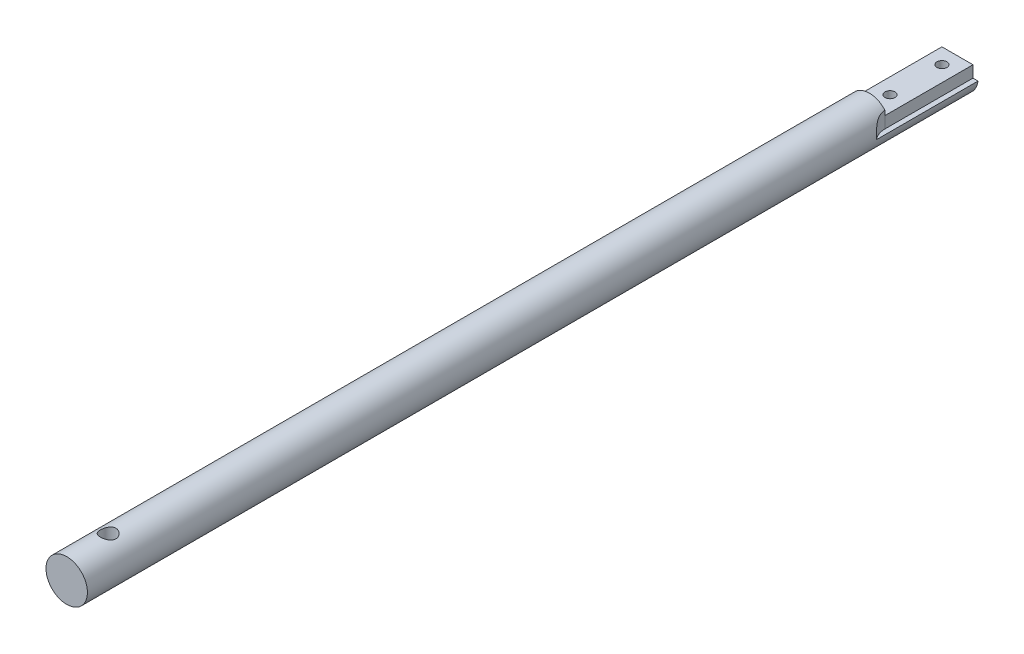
from build123d import *

# Parameters (mm, degrees)
SKETCH1_R                              = 3.175
EXTRUDE1_DEPTH                         = 136.525
CUT_EXTRUDE1_DEPTH                     = 13.49375
CUT_EXTRUDE2_DEPTH                     = 137.608410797
F_0_80_TAPPED_HOLE1_D                  = 1.524
F_3_32_0_09375_PF_DWL_DIAMETER_HOLE3_D = 2.3749


with BuildPart() as part:
    # Sketch1 → Extrude1 (new body)
    with BuildSketch(Plane(origin=(0, 0, 0), x_dir=(-1, 0, 0), z_dir=(0, 0, -1))):
        Circle(SKETCH1_R)
    extrude(amount=-EXTRUDE1_DEPTH)

    # Sketch3 → Cut-Extrude1 (cut)
    with BuildSketch(Plane(origin=(0, 0, 0), x_dir=(-1, 0, 0), z_dir=(0, 0, -1))):
        Polygon((4.8895, -0.3889375), (2.38125, -0.3889375), (2.38125, 1.3890625), (-2.38125, 1.3890625), (-2.38125, -0.3889375), (-4.6355, -0.3889375), (-4.6355, 4.3735625), (4.8895, 4.3735625), align=None)
    extrude(amount=-CUT_EXTRUDE1_DEPTH, mode=Mode.SUBTRACT)

    # Sketch4 → Cut-Extrude2 (cut, through all)
    with BuildSketch(Plane(origin=(0, -0.3889375, 0), x_dir=(-1, 0, 0), z_dir=(0, 1, 0))):
        with BuildLine():
            Line((-2.38125, 10.318877), (-8.73125, 10.318877))
            Line((-8.73125, 10.318877), (-8.73125, 16.668877))
            Line((-8.73125, 16.668877), (-5.55625, 16.668877))
            ThreePointArc((-5.55625, 16.668877), (-3.31118597, 15.73894103), (-2.38125, 13.493877))
            Line((-2.38125, 13.493877), (-2.38125, 10.318877))
        make_face()
        with BuildLine():
            Line((8.73125, 10.318877), (8.73125, 16.668877))
            Line((8.73125, 16.668877), (5.55625, 16.668877))
            ThreePointArc((5.55625, 16.668877), (3.31118597, 15.73894103), (2.38125, 13.493877))
            Line((2.38125, 13.493877), (2.38125, 10.318877))
            Line((2.38125, 10.318877), (8.73125, 10.318877))
        make_face()
    extrude(amount=CUT_EXTRUDE2_DEPTH, mode=Mode.SUBTRACT)

    # 0-80 Tapped Hole1 (through all)
    with Locations(Plane(origin=(0, 1.3890625, 0), x_dir=(-1, 0, 0), z_dir=(0, 1, 0))):
        with Locations((0.003634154, 10.3378), (0.015904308, 2.3622)):
            Hole(F_0_80_TAPPED_HOLE1_D / 2)

    # 3_32 _0.09375_ PF DWL Diameter Hole3 (through all)
    with Locations(Plane(origin=(0, -3.2004, 0), x_dir=(-1, 0, 0), z_dir=(0, -1, 0))):
        with Locations((0, -130.175)):
            Hole(F_3_32_0_09375_PF_DWL_DIAMETER_HOLE3_D / 2)


solid = part.part
